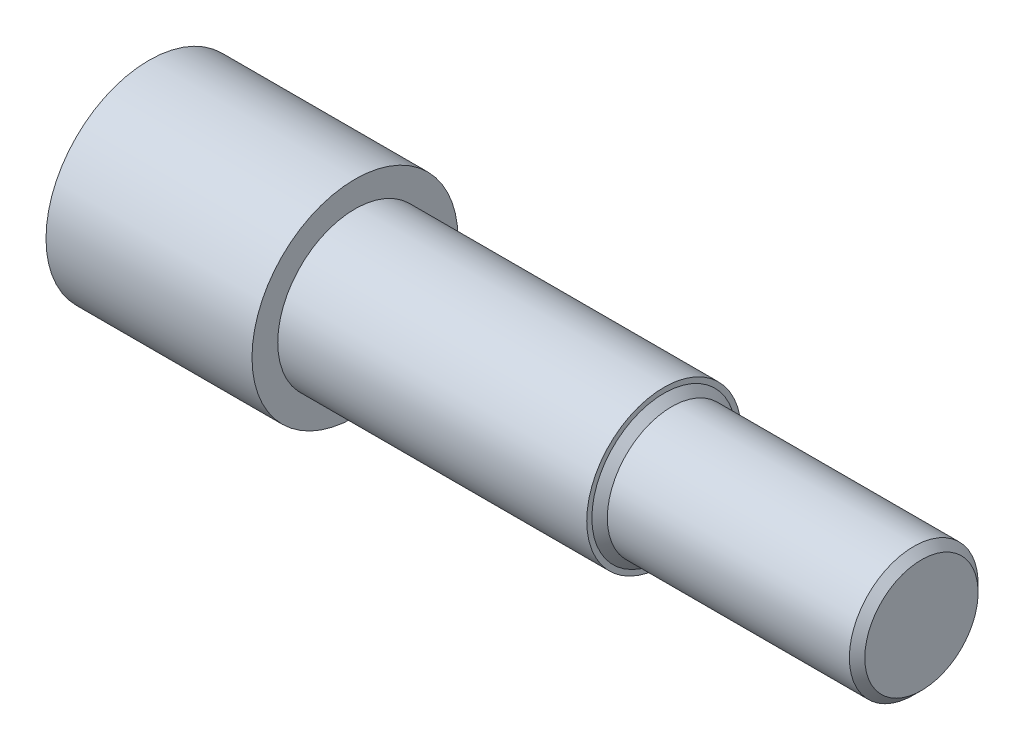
ISO-10303-21;
HEADER;
FILE_DESCRIPTION(('STEP AP214'),'2;1');
FILE_NAME('part.step','',(''),(''),'','','');
FILE_SCHEMA(('AUTOMOTIVE_DESIGN { 1 0 10303 214 1 1 1 1 }'));
ENDSEC;
DATA;
#1=APPLICATION_CONTEXT('core data for automotive mechanical design processes');
#2=APPLICATION_PROTOCOL_DEFINITION('international standard','automotive_design',2000,#1);
#3=PRODUCT_CONTEXT('',#1,'mechanical');
#4=PRODUCT('Part','Part','',(#3));
#5=PRODUCT_RELATED_PRODUCT_CATEGORY('part','',(#4));
#6=PRODUCT_DEFINITION_FORMATION('','',#4);
#7=PRODUCT_DEFINITION_CONTEXT('part definition',#1,'design');
#8=PRODUCT_DEFINITION('design','',#6,#7);
#9=PRODUCT_DEFINITION_SHAPE('','',#8);
#10=(LENGTH_UNIT() NAMED_UNIT(*) SI_UNIT(.MILLI.,.METRE.));
#11=(NAMED_UNIT(*) PLANE_ANGLE_UNIT() SI_UNIT($,.RADIAN.));
#12=(NAMED_UNIT(*) SI_UNIT($,.STERADIAN.) SOLID_ANGLE_UNIT());
#13=UNCERTAINTY_MEASURE_WITH_UNIT(LENGTH_MEASURE(1.E-05),#10,'distance_accuracy_value','');
#14=(GEOMETRIC_REPRESENTATION_CONTEXT(3) GLOBAL_UNCERTAINTY_ASSIGNED_CONTEXT((#13)) GLOBAL_UNIT_ASSIGNED_CONTEXT((#10,
#11,#12)) REPRESENTATION_CONTEXT('',''));
#15=CARTESIAN_POINT('',(0.,0.,0.));
#16=DIRECTION('',(0.,0.,1.));
#17=DIRECTION('',(1.,0.,0.));
#18=AXIS2_PLACEMENT_3D('',#15,#16,#17);
#19=CARTESIAN_POINT('',(0.,0.,0.));
#20=DIRECTION('',(1.,0.,0.));
#21=DIRECTION('',(0.,0.,-1.));
#22=AXIS2_PLACEMENT_3D('',#19,#20,#21);
#23=PLANE('',#22);
#24=CARTESIAN_POINT('',(0.,0.,0.));
#25=DIRECTION('',(-1.,0.,0.));
#26=DIRECTION('',(0.,0.,1.));
#27=AXIS2_PLACEMENT_3D('',#24,#25,#26);
#28=CIRCLE('',#27,20.);
#29=CARTESIAN_POINT('',(0.,0.,20.));
#30=VERTEX_POINT('',#29);
#31=EDGE_CURVE('E122',#30,#30,#28,.T.);
#32=ORIENTED_EDGE('',*,*,#31,.T.);
#33=EDGE_LOOP('',(#32));
#34=FACE_BOUND('',#33,.T.);
#35=ADVANCED_FACE('F43',(#34),#23,.F.);
#36=CARTESIAN_POINT('',(0.,0.,0.));
#37=DIRECTION('',(-1.,0.,0.));
#38=DIRECTION('',(0.,0.,1.));
#39=AXIS2_PLACEMENT_3D('',#36,#37,#38);
#40=CYLINDRICAL_SURFACE('',#39,20.);
#41=ORIENTED_EDGE('',*,*,#31,.F.);
#42=EDGE_LOOP('',(#41));
#43=FACE_BOUND('',#42,.T.);
#44=CARTESIAN_POINT('',(40.,0.,0.));
#45=DIRECTION('',(-1.,0.,0.));
#46=DIRECTION('',(0.,0.,1.));
#47=AXIS2_PLACEMENT_3D('',#44,#45,#46);
#48=CIRCLE('',#47,20.);
#49=CARTESIAN_POINT('',(40.,0.,20.));
#50=VERTEX_POINT('',#49);
#51=EDGE_CURVE('E117',#50,#50,#48,.T.);
#52=ORIENTED_EDGE('',*,*,#51,.T.);
#53=EDGE_LOOP('',(#52));
#54=FACE_BOUND('',#53,.T.);
#55=ADVANCED_FACE('F174',(#43,#54),#40,.T.);
#56=CARTESIAN_POINT('',(40.,20.,0.));
#57=DIRECTION('',(-1.,0.,0.));
#58=DIRECTION('',(0.,0.,1.));
#59=AXIS2_PLACEMENT_3D('',#56,#57,#58);
#60=PLANE('',#59);
#61=ORIENTED_EDGE('',*,*,#51,.F.);
#62=EDGE_LOOP('',(#61));
#63=FACE_BOUND('',#62,.T.);
#64=CARTESIAN_POINT('',(40.,0.,0.));
#65=DIRECTION('',(-1.,0.,0.));
#66=DIRECTION('',(0.,0.,1.));
#67=AXIS2_PLACEMENT_3D('',#64,#65,#66);
#68=CIRCLE('',#67,15.);
#69=CARTESIAN_POINT('',(40.,0.,15.));
#70=VERTEX_POINT('',#69);
#71=EDGE_CURVE('E113',#70,#70,#68,.T.);
#72=ORIENTED_EDGE('',*,*,#71,.T.);
#73=EDGE_LOOP('',(#72));
#74=FACE_BOUND('',#73,.T.);
#75=ADVANCED_FACE('F164',(#63,#74),#60,.F.);
#76=CARTESIAN_POINT('',(0.,0.,0.));
#77=DIRECTION('',(-1.,0.,0.));
#78=DIRECTION('',(0.,0.,1.));
#79=AXIS2_PLACEMENT_3D('',#76,#77,#78);
#80=CYLINDRICAL_SURFACE('',#79,15.);
#81=DIRECTION('',(-1.,0.,0.));
#82=VECTOR('',#81,1.);
#83=CARTESIAN_POINT('',(0.,-14.456832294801,4.));
#84=LINE('',#83,#82);
#85=CARTESIAN_POINT('',(50.,-14.456832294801,4.));
#86=VERTEX_POINT('',#85);
#87=CARTESIAN_POINT('',(80.,-14.456832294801,4.));
#88=VERTEX_POINT('',#87);
#89=EDGE_CURVE('E126',#86,#88,#84,.F.);
#90=ORIENTED_EDGE('',*,*,#89,.T.);
#91=CARTESIAN_POINT('',(80.,0.,0.));
#92=DIRECTION('',(1.,0.,0.));
#93=DIRECTION('',(0.,0.,-1.));
#94=AXIS2_PLACEMENT_3D('',#91,#92,#93);
#95=CIRCLE('',#94,15.);
#96=CARTESIAN_POINT('',(80.,-14.456832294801,-4.));
#97=VERTEX_POINT('',#96);
#98=EDGE_CURVE('E70',#88,#97,#95,.T.);
#99=ORIENTED_EDGE('',*,*,#98,.T.);
#100=DIRECTION('',(-1.,0.,0.));
#101=VECTOR('',#100,1.);
#102=CARTESIAN_POINT('',(0.,-14.456832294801,-4.));
#103=LINE('',#102,#101);
#104=CARTESIAN_POINT('',(50.,-14.456832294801,-4.));
#105=VERTEX_POINT('',#104);
#106=EDGE_CURVE('E86',#97,#105,#103,.T.);
#107=ORIENTED_EDGE('',*,*,#106,.T.);
#108=CARTESIAN_POINT('',(50.,0.,0.));
#109=DIRECTION('',(-1.,0.,0.));
#110=DIRECTION('',(0.,0.,1.));
#111=AXIS2_PLACEMENT_3D('',#108,#109,#110);
#112=CIRCLE('',#111,15.);
#113=EDGE_CURVE('E121',#105,#86,#112,.T.);
#114=ORIENTED_EDGE('',*,*,#113,.T.);
#115=EDGE_LOOP('',(#90,#99,#107,#114));
#116=FACE_BOUND('',#115,.T.);
#117=ORIENTED_EDGE('',*,*,#71,.F.);
#118=EDGE_LOOP('',(#117));
#119=FACE_BOUND('',#118,.T.);
#120=CARTESIAN_POINT('',(100.,0.,0.));
#121=DIRECTION('',(-1.,0.,0.));
#122=DIRECTION('',(0.,0.,1.));
#123=AXIS2_PLACEMENT_3D('',#120,#121,#122);
#124=CIRCLE('',#123,15.);
#125=CARTESIAN_POINT('',(100.,0.,15.));
#126=VERTEX_POINT('',#125);
#127=EDGE_CURVE('E108',#126,#126,#124,.T.);
#128=ORIENTED_EDGE('',*,*,#127,.T.);
#129=EDGE_LOOP('',(#128));
#130=FACE_BOUND('',#129,.T.);
#131=ADVANCED_FACE('F159',(#116,#119,#130),#80,.T.);
#132=CARTESIAN_POINT('',(100.,15.,0.));
#133=DIRECTION('',(-1.,0.,0.));
#134=DIRECTION('',(0.,0.,1.));
#135=AXIS2_PLACEMENT_3D('',#132,#133,#134);
#136=PLANE('',#135);
#137=CARTESIAN_POINT('',(100.,0.,0.));
#138=DIRECTION('',(-1.,0.,0.));
#139=DIRECTION('',(0.,0.,1.));
#140=AXIS2_PLACEMENT_3D('',#137,#138,#139);
#141=CIRCLE('',#140,14.0000000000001);
#142=CARTESIAN_POINT('',(100.,0.,14.));
#143=VERTEX_POINT('',#142);
#144=EDGE_CURVE('E11',#143,#143,#141,.T.);
#145=ORIENTED_EDGE('',*,*,#144,.T.);
#146=EDGE_LOOP('',(#145));
#147=FACE_BOUND('',#146,.T.);
#148=ORIENTED_EDGE('',*,*,#127,.F.);
#149=EDGE_LOOP('',(#148));
#150=FACE_BOUND('',#149,.T.);
#151=ADVANCED_FACE('F147',(#147,#150),#136,.F.);
#152=CARTESIAN_POINT('',(0.,0.,0.));
#153=DIRECTION('',(-1.,0.,0.));
#154=DIRECTION('',(0.,0.,1.));
#155=AXIS2_PLACEMENT_3D('',#152,#153,#154);
#156=CYLINDRICAL_SURFACE('',#155,12.5);
#157=CARTESIAN_POINT('',(148.5,0.,0.));
#158=DIRECTION('',(-1.,0.,0.));
#159=DIRECTION('',(0.,0.,1.));
#160=AXIS2_PLACEMENT_3D('',#157,#158,#159);
#161=CIRCLE('',#160,12.5);
#162=CARTESIAN_POINT('',(148.5,0.,12.5));
#163=VERTEX_POINT('',#162);
#164=EDGE_CURVE('E131',#163,#163,#161,.T.);
#165=ORIENTED_EDGE('',*,*,#164,.T.);
#166=EDGE_LOOP('',(#165));
#167=FACE_BOUND('',#166,.T.);
#168=CARTESIAN_POINT('',(101.5,0.,0.));
#169=DIRECTION('',(-1.,0.,0.));
#170=DIRECTION('',(0.,0.,1.));
#171=AXIS2_PLACEMENT_3D('',#168,#169,#170);
#172=CIRCLE('',#171,12.5);
#173=CARTESIAN_POINT('',(101.5,0.,12.5));
#174=VERTEX_POINT('',#173);
#175=EDGE_CURVE('E134',#174,#174,#172,.F.);
#176=ORIENTED_EDGE('',*,*,#175,.T.);
#177=EDGE_LOOP('',(#176));
#178=FACE_BOUND('',#177,.T.);
#179=ADVANCED_FACE('F150',(#167,#178),#156,.T.);
#180=CARTESIAN_POINT('',(150.,12.5,0.));
#181=DIRECTION('',(-1.,0.,0.));
#182=DIRECTION('',(0.,0.,1.));
#183=AXIS2_PLACEMENT_3D('',#180,#181,#182);
#184=PLANE('',#183);
#185=CARTESIAN_POINT('',(150.,0.,0.));
#186=DIRECTION('',(-1.,0.,0.));
#187=DIRECTION('',(0.,0.,1.));
#188=AXIS2_PLACEMENT_3D('',#185,#186,#187);
#189=CIRCLE('',#188,11.);
#190=CARTESIAN_POINT('',(150.,0.,11.));
#191=VERTEX_POINT('',#190);
#192=EDGE_CURVE('E55',#191,#191,#189,.F.);
#193=ORIENTED_EDGE('',*,*,#192,.T.);
#194=EDGE_LOOP('',(#193));
#195=FACE_BOUND('',#194,.T.);
#196=ADVANCED_FACE('F136',(#195),#184,.F.);
#197=CARTESIAN_POINT('',(80.,-19.,4.));
#198=DIRECTION('',(1.,0.,0.));
#199=DIRECTION('',(0.,0.,-1.));
#200=AXIS2_PLACEMENT_3D('',#197,#198,#199);
#201=PLANE('',#200);
#202=DIRECTION('',(0.,1.,0.));
#203=VECTOR('',#202,1.);
#204=CARTESIAN_POINT('',(80.,-19.,4.));
#205=LINE('',#204,#203);
#206=CARTESIAN_POINT('',(80.,0.,4.));
#207=VERTEX_POINT('',#206);
#208=EDGE_CURVE('E103',#88,#207,#205,.T.);
#209=ORIENTED_EDGE('',*,*,#208,.T.);
#210=DIRECTION('',(0.,0.,-1.));
#211=VECTOR('',#210,1.);
#212=CARTESIAN_POINT('',(80.,0.,4.));
#213=LINE('',#212,#211);
#214=CARTESIAN_POINT('',(80.,0.,-4.));
#215=VERTEX_POINT('',#214);
#216=EDGE_CURVE('E100',#207,#215,#213,.T.);
#217=ORIENTED_EDGE('',*,*,#216,.T.);
#218=DIRECTION('',(0.,1.,0.));
#219=VECTOR('',#218,1.);
#220=CARTESIAN_POINT('',(80.,-19.,-4.));
#221=LINE('',#220,#219);
#222=EDGE_CURVE('E83',#97,#215,#221,.T.);
#223=ORIENTED_EDGE('',*,*,#222,.F.);
#224=ORIENTED_EDGE('',*,*,#98,.F.);
#225=EDGE_LOOP('',(#209,#217,#223,#224));
#226=FACE_BOUND('',#225,.T.);
#227=ADVANCED_FACE('F105',(#226),#201,.F.);
#228=CARTESIAN_POINT('',(50.,-19.,4.));
#229=DIRECTION('',(0.,0.,1.));
#230=DIRECTION('',(1.,0.,0.));
#231=AXIS2_PLACEMENT_3D('',#228,#229,#230);
#232=PLANE('',#231);
#233=DIRECTION('',(0.,1.,0.));
#234=VECTOR('',#233,1.);
#235=CARTESIAN_POINT('',(50.,-19.,4.));
#236=LINE('',#235,#234);
#237=CARTESIAN_POINT('',(50.,0.,4.));
#238=VERTEX_POINT('',#237);
#239=EDGE_CURVE('E109',#86,#238,#236,.T.);
#240=ORIENTED_EDGE('',*,*,#239,.T.);
#241=DIRECTION('',(1.,0.,0.));
#242=VECTOR('',#241,1.);
#243=CARTESIAN_POINT('',(50.,0.,4.));
#244=LINE('',#243,#242);
#245=EDGE_CURVE('E89',#238,#207,#244,.T.);
#246=ORIENTED_EDGE('',*,*,#245,.T.);
#247=ORIENTED_EDGE('',*,*,#208,.F.);
#248=ORIENTED_EDGE('',*,*,#89,.F.);
#249=EDGE_LOOP('',(#240,#246,#247,#248));
#250=FACE_BOUND('',#249,.T.);
#251=ADVANCED_FACE('F231',(#250),#232,.F.);
#252=CARTESIAN_POINT('',(50.,-19.,4.));
#253=DIRECTION('',(-1.,0.,0.));
#254=DIRECTION('',(0.,0.,1.));
#255=AXIS2_PLACEMENT_3D('',#252,#253,#254);
#256=PLANE('',#255);
#257=DIRECTION('',(0.,1.,0.));
#258=VECTOR('',#257,1.);
#259=CARTESIAN_POINT('',(50.,-19.,-4.));
#260=LINE('',#259,#258);
#261=CARTESIAN_POINT('',(50.,0.,-4.));
#262=VERTEX_POINT('',#261);
#263=EDGE_CURVE('E56',#105,#262,#260,.T.);
#264=ORIENTED_EDGE('',*,*,#263,.T.);
#265=DIRECTION('',(0.,0.,1.));
#266=VECTOR('',#265,1.);
#267=CARTESIAN_POINT('',(50.,0.,4.));
#268=LINE('',#267,#266);
#269=EDGE_CURVE('E99',#262,#238,#268,.T.);
#270=ORIENTED_EDGE('',*,*,#269,.T.);
#271=ORIENTED_EDGE('',*,*,#239,.F.);
#272=ORIENTED_EDGE('',*,*,#113,.F.);
#273=EDGE_LOOP('',(#264,#270,#271,#272));
#274=FACE_BOUND('',#273,.T.);
#275=ADVANCED_FACE('F245',(#274),#256,.F.);
#276=CARTESIAN_POINT('',(50.,-19.,-4.));
#277=DIRECTION('',(0.,0.,-1.));
#278=DIRECTION('',(-1.,0.,0.));
#279=AXIS2_PLACEMENT_3D('',#276,#277,#278);
#280=PLANE('',#279);
#281=ORIENTED_EDGE('',*,*,#222,.T.);
#282=DIRECTION('',(-1.,0.,0.));
#283=VECTOR('',#282,1.);
#284=CARTESIAN_POINT('',(50.,0.,-4.));
#285=LINE('',#284,#283);
#286=EDGE_CURVE('E88',#215,#262,#285,.T.);
#287=ORIENTED_EDGE('',*,*,#286,.T.);
#288=ORIENTED_EDGE('',*,*,#263,.F.);
#289=ORIENTED_EDGE('',*,*,#106,.F.);
#290=EDGE_LOOP('',(#281,#287,#288,#289));
#291=FACE_BOUND('',#290,.T.);
#292=ADVANCED_FACE('F81',(#291),#280,.F.);
#293=CARTESIAN_POINT('',(0.,0.,0.));
#294=DIRECTION('',(0.,-1.,0.));
#295=DIRECTION('',(0.,0.,-1.));
#296=AXIS2_PLACEMENT_3D('',#293,#294,#295);
#297=PLANE('',#296);
#298=ORIENTED_EDGE('',*,*,#216,.F.);
#299=ORIENTED_EDGE('',*,*,#245,.F.);
#300=ORIENTED_EDGE('',*,*,#269,.F.);
#301=ORIENTED_EDGE('',*,*,#286,.F.);
#302=EDGE_LOOP('',(#298,#299,#300,#301));
#303=FACE_BOUND('',#302,.T.);
#304=ADVANCED_FACE('F92',(#303),#297,.T.);
#305=CARTESIAN_POINT('',(148.5,0.,0.));
#306=DIRECTION('',(-1.,0.,0.));
#307=DIRECTION('',(0.,0.,1.));
#308=AXIS2_PLACEMENT_3D('',#305,#306,#307);
#309=CONICAL_SURFACE('',#308,12.5,0.78539816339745);
#310=ORIENTED_EDGE('',*,*,#192,.F.);
#311=EDGE_LOOP('',(#310));
#312=FACE_BOUND('',#311,.T.);
#313=ORIENTED_EDGE('',*,*,#164,.F.);
#314=EDGE_LOOP('',(#313));
#315=FACE_BOUND('',#314,.T.);
#316=ADVANCED_FACE('F142',(#312,#315),#309,.T.);
#317=CARTESIAN_POINT('',(100.,0.,0.));
#318=DIRECTION('',(-1.,0.,0.));
#319=DIRECTION('',(0.,0.,1.));
#320=AXIS2_PLACEMENT_3D('',#317,#318,#319);
#321=CONICAL_SURFACE('',#320,14.0000000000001,0.785398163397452);
#322=CARTESIAN_POINT('',(101.5,0.,12.5));
#323=CARTESIAN_POINT('',(101.484375,0.,12.515625));
#324=CARTESIAN_POINT('',(101.46875,0.,12.53125));
#325=CARTESIAN_POINT('',(101.4375,0.,12.5625));
#326=CARTESIAN_POINT('',(101.421875,0.,12.578125));
#327=CARTESIAN_POINT('',(101.390625,0.,12.609375));
#328=CARTESIAN_POINT('',(101.375,0.,12.625));
#329=CARTESIAN_POINT('',(101.34375,0.,12.65625));
#330=CARTESIAN_POINT('',(101.328125,0.,12.671875));
#331=CARTESIAN_POINT('',(101.296875,0.,12.703125));
#332=CARTESIAN_POINT('',(101.28125,0.,12.71875));
#333=CARTESIAN_POINT('',(101.25,0.,12.75));
#334=CARTESIAN_POINT('',(101.234375,0.,12.765625));
#335=CARTESIAN_POINT('',(101.203125,0.,12.796875));
#336=CARTESIAN_POINT('',(101.1875,0.,12.8125));
#337=CARTESIAN_POINT('',(101.15625,0.,12.84375));
#338=CARTESIAN_POINT('',(101.140625,0.,12.859375));
#339=CARTESIAN_POINT('',(101.109375,0.,12.890625));
#340=CARTESIAN_POINT('',(101.09375,0.,12.90625));
#341=CARTESIAN_POINT('',(101.0625,0.,12.9375));
#342=CARTESIAN_POINT('',(101.046875,0.,12.953125));
#343=CARTESIAN_POINT('',(101.015625,0.,12.984375));
#344=CARTESIAN_POINT('',(101.,0.,13.));
#345=CARTESIAN_POINT('',(100.96875,0.,13.03125));
#346=CARTESIAN_POINT('',(100.953125,0.,13.046875));
#347=CARTESIAN_POINT('',(100.921875,0.,13.078125));
#348=CARTESIAN_POINT('',(100.90625,0.,13.09375));
#349=CARTESIAN_POINT('',(100.875,0.,13.125));
#350=CARTESIAN_POINT('',(100.859375,0.,13.140625));
#351=CARTESIAN_POINT('',(100.828125,0.,13.171875));
#352=CARTESIAN_POINT('',(100.8125,0.,13.1875));
#353=CARTESIAN_POINT('',(100.78125,0.,13.21875));
#354=CARTESIAN_POINT('',(100.765625,0.,13.234375));
#355=CARTESIAN_POINT('',(100.734375,0.,13.265625));
#356=CARTESIAN_POINT('',(100.71875,0.,13.28125));
#357=CARTESIAN_POINT('',(100.6875,0.,13.3125));
#358=CARTESIAN_POINT('',(100.671875,0.,13.328125));
#359=CARTESIAN_POINT('',(100.640625,0.,13.359375));
#360=CARTESIAN_POINT('',(100.625,0.,13.375));
#361=CARTESIAN_POINT('',(100.59375,0.,13.40625));
#362=CARTESIAN_POINT('',(100.578125,0.,13.421875));
#363=CARTESIAN_POINT('',(100.546875,0.,13.453125));
#364=CARTESIAN_POINT('',(100.53125,0.,13.46875));
#365=CARTESIAN_POINT('',(100.5,0.,13.5));
#366=CARTESIAN_POINT('',(100.484375,0.,13.515625));
#367=CARTESIAN_POINT('',(100.453125,0.,13.546875));
#368=CARTESIAN_POINT('',(100.4375,0.,13.5625));
#369=CARTESIAN_POINT('',(100.40625,0.,13.59375));
#370=CARTESIAN_POINT('',(100.390625,0.,13.609375));
#371=CARTESIAN_POINT('',(100.359375,0.,13.640625));
#372=CARTESIAN_POINT('',(100.34375,0.,13.65625));
#373=CARTESIAN_POINT('',(100.3125,0.,13.6875));
#374=CARTESIAN_POINT('',(100.296875,0.,13.703125));
#375=CARTESIAN_POINT('',(100.265625,0.,13.734375));
#376=CARTESIAN_POINT('',(100.25,0.,13.75));
#377=CARTESIAN_POINT('',(100.21875,0.,13.78125));
#378=CARTESIAN_POINT('',(100.203125,0.,13.796875));
#379=CARTESIAN_POINT('',(100.171875,0.,13.828125));
#380=CARTESIAN_POINT('',(100.15625,0.,13.84375));
#381=CARTESIAN_POINT('',(100.125,0.,13.875));
#382=CARTESIAN_POINT('',(100.109375,0.,13.890625));
#383=CARTESIAN_POINT('',(100.078125,0.,13.921875));
#384=CARTESIAN_POINT('',(100.0625,0.,13.9375));
#385=CARTESIAN_POINT('',(100.03125,0.,13.96875));
#386=CARTESIAN_POINT('',(100.015625,0.,13.984375));
#387=CARTESIAN_POINT('',(100.,0.,14.));
#388=B_SPLINE_CURVE_WITH_KNOTS('',3,(#322,#323,#324,#325,#326,#327,#328,#329,#330,#331,#332,
#333,#334,#335,#336,#337,#338,#339,#340,#341,#342,#343,#344,#345,#346,#347,#348,#349,#350,#351,
#352,#353,#354,#355,#356,#357,#358,#359,#360,#361,#362,#363,#364,#365,#366,#367,#368,#369,#370,
#371,#372,#373,#374,#375,#376,#377,#378,#379,#380,#381,#382,#383,#384,#385,#386,#387),
.UNSPECIFIED.,.F.,.F.,(4,2,2,2,2,2,2,2,2,2,2,2,2,2,2,2,2,2,2,2,2,2,2,2,2,2,2,2,2,2,2,2,4),(0.,
0.0662912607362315,0.132582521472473,0.198873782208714,0.265165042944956,0.331456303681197,
0.397747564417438,0.46403882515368,0.530330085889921,0.596621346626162,0.662912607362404,
0.729203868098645,0.795495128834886,0.861786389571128,0.928077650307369,0.99436891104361,
1.06066017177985,1.12695143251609,1.19324269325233,1.25953395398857,1.32582521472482,
1.39211647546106,1.4584077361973,1.52469899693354,1.59099025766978,1.65728151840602,
1.72357277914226,1.78986403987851,1.85615530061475,1.92244656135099,1.98873782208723,
2.05502908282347,2.12132034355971),.UNSPECIFIED.);
#389=EDGE_CURVE('BSEAM46',#174,#143,#388,.T.);
#390=ORIENTED_EDGE('',*,*,#175,.F.);
#391=ORIENTED_EDGE('',*,*,#144,.F.);
#392=ORIENTED_EDGE('',*,*,#389,.T.);
#393=ORIENTED_EDGE('',*,*,#389,.F.);
#394=EDGE_LOOP('',(#390,#392,#391,#393));
#395=FACE_BOUND('',#394,.T.);
#396=ADVANCED_FACE('F46',(#395),#321,.T.);
#397=CLOSED_SHELL('',(#35,#55,#75,#131,#151,#179,#196,#227,#251,#275,#292,#304,#316,#396));
#398=MANIFOLD_SOLID_BREP('B2',#397);
#399=ADVANCED_BREP_SHAPE_REPRESENTATION('',(#18,#398),#14);
#400=SHAPE_DEFINITION_REPRESENTATION(#9,#399);
ENDSEC;
END-ISO-10303-21;
